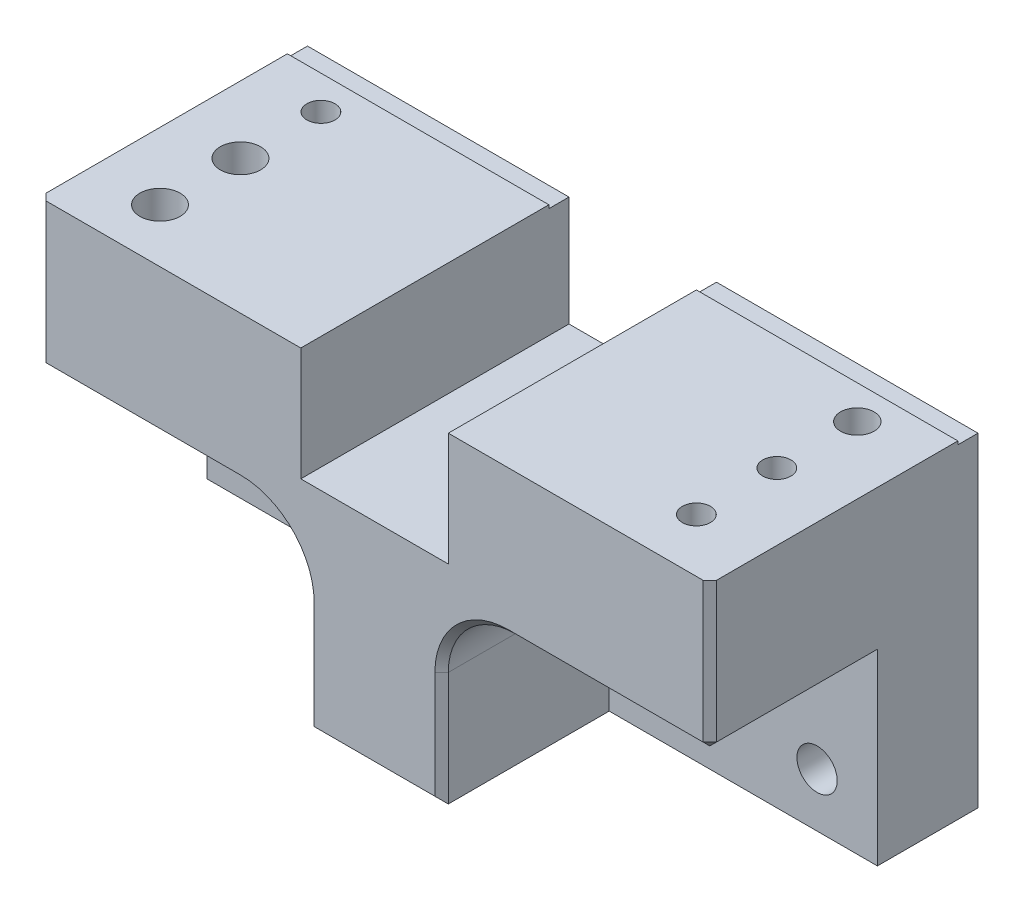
ISO-10303-21;
HEADER;
FILE_DESCRIPTION(('STEP AP214'),'2;1');
FILE_NAME('part.step','',(''),(''),'','','');
FILE_SCHEMA(('AUTOMOTIVE_DESIGN { 1 0 10303 214 1 1 1 1 }'));
ENDSEC;
DATA;
#1=APPLICATION_CONTEXT('core data for automotive mechanical design processes');
#2=APPLICATION_PROTOCOL_DEFINITION('international standard','automotive_design',2000,#1);
#3=PRODUCT_CONTEXT('',#1,'mechanical');
#4=PRODUCT('Part','Part','',(#3));
#5=PRODUCT_RELATED_PRODUCT_CATEGORY('part','',(#4));
#6=PRODUCT_DEFINITION_FORMATION('','',#4);
#7=PRODUCT_DEFINITION_CONTEXT('part definition',#1,'design');
#8=PRODUCT_DEFINITION('design','',#6,#7);
#9=PRODUCT_DEFINITION_SHAPE('','',#8);
#10=(LENGTH_UNIT() NAMED_UNIT(*) SI_UNIT(.MILLI.,.METRE.));
#11=(NAMED_UNIT(*) PLANE_ANGLE_UNIT() SI_UNIT($,.RADIAN.));
#12=(NAMED_UNIT(*) SI_UNIT($,.STERADIAN.) SOLID_ANGLE_UNIT());
#13=UNCERTAINTY_MEASURE_WITH_UNIT(LENGTH_MEASURE(1.E-05),#10,'distance_accuracy_value','');
#14=(GEOMETRIC_REPRESENTATION_CONTEXT(3) GLOBAL_UNCERTAINTY_ASSIGNED_CONTEXT((#13)) GLOBAL_UNIT_ASSIGNED_CONTEXT((#10,
#11,#12)) REPRESENTATION_CONTEXT('',''));
#15=CARTESIAN_POINT('',(0.,0.,0.));
#16=DIRECTION('',(0.,0.,1.));
#17=DIRECTION('',(1.,0.,0.));
#18=AXIS2_PLACEMENT_3D('',#15,#16,#17);
#19=CARTESIAN_POINT('',(-50.,48.9,40.));
#20=DIRECTION('',(1.,0.,0.));
#21=DIRECTION('',(0.,1.,0.));
#22=AXIS2_PLACEMENT_3D('',#19,#20,#21);
#23=PLANE('',#22);
#24=DIRECTION('',(0.,-1.,0.));
#25=VECTOR('',#24,1.);
#26=CARTESIAN_POINT('',(-50.,27.,15.));
#27=LINE('',#26,#25);
#28=CARTESIAN_POINT('',(-50.,28.,15.));
#29=VERTEX_POINT('',#28);
#30=CARTESIAN_POINT('',(-50.,0.,15.));
#31=VERTEX_POINT('',#30);
#32=EDGE_CURVE('E289',#29,#31,#27,.T.);
#33=ORIENTED_EDGE('',*,*,#32,.F.);
#34=DIRECTION('',(0.,0.,1.));
#35=VECTOR('',#34,1.);
#36=CARTESIAN_POINT('',(-50.,28.,40.));
#37=LINE('',#36,#35);
#38=CARTESIAN_POINT('',(-50.,28.,39.));
#39=VERTEX_POINT('',#38);
#40=EDGE_CURVE('E400',#29,#39,#37,.T.);
#41=ORIENTED_EDGE('',*,*,#40,.T.);
#42=DIRECTION('',(0.,1.,0.));
#43=VECTOR('',#42,1.);
#44=CARTESIAN_POINT('',(-50.,48.9,39.));
#45=LINE('',#44,#43);
#46=CARTESIAN_POINT('',(-50.,48.9,39.));
#47=VERTEX_POINT('',#46);
#48=EDGE_CURVE('E229',#39,#47,#45,.T.);
#49=ORIENTED_EDGE('',*,*,#48,.T.);
#50=DIRECTION('',(0.,0.,-1.));
#51=VECTOR('',#50,1.);
#52=CARTESIAN_POINT('',(-50.,48.9,40.));
#53=LINE('',#52,#51);
#54=CARTESIAN_POINT('',(-50.,48.9,3.00000000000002));
#55=VERTEX_POINT('',#54);
#56=EDGE_CURVE('E223',#47,#55,#53,.T.);
#57=ORIENTED_EDGE('',*,*,#56,.T.);
#58=DIRECTION('',(0.,1.,0.));
#59=VECTOR('',#58,1.);
#60=CARTESIAN_POINT('',(-50.,48.4,3.00000000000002));
#61=LINE('',#60,#59);
#62=CARTESIAN_POINT('',(-50.,48.4,3.00000000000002));
#63=VERTEX_POINT('',#62);
#64=EDGE_CURVE('E226',#63,#55,#61,.T.);
#65=ORIENTED_EDGE('',*,*,#64,.F.);
#66=DIRECTION('',(0.,0.,1.));
#67=VECTOR('',#66,1.);
#68=CARTESIAN_POINT('',(-50.,48.4,3.00000000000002));
#69=LINE('',#68,#67);
#70=CARTESIAN_POINT('',(-50.,48.4,0.));
#71=VERTEX_POINT('',#70);
#72=EDGE_CURVE('E260',#71,#63,#69,.T.);
#73=ORIENTED_EDGE('',*,*,#72,.F.);
#74=DIRECTION('',(0.,-1.,0.));
#75=VECTOR('',#74,1.);
#76=CARTESIAN_POINT('',(-50.,48.9,0.));
#77=LINE('',#76,#75);
#78=CARTESIAN_POINT('',(-50.,0.,0.));
#79=VERTEX_POINT('',#78);
#80=EDGE_CURVE('E354',#71,#79,#77,.T.);
#81=ORIENTED_EDGE('',*,*,#80,.T.);
#82=DIRECTION('',(0.,0.,-1.));
#83=VECTOR('',#82,1.);
#84=CARTESIAN_POINT('',(-50.,0.,40.));
#85=LINE('',#84,#83);
#86=EDGE_CURVE('E393',#31,#79,#85,.T.);
#87=ORIENTED_EDGE('',*,*,#86,.F.);
#88=EDGE_LOOP('',(#33,#41,#49,#57,#65,#73,#81,#87));
#89=FACE_BOUND('',#88,.T.);
#90=ADVANCED_FACE('F36',(#89),#23,.F.);
#91=CARTESIAN_POINT('',(-50.,0.,40.));
#92=DIRECTION('',(0.,1.,0.));
#93=DIRECTION('',(-1.,0.,0.));
#94=AXIS2_PLACEMENT_3D('',#91,#92,#93);
#95=PLANE('',#94);
#96=DIRECTION('',(0.,0.,1.));
#97=VECTOR('',#96,1.);
#98=CARTESIAN_POINT('',(10.,0.,15.));
#99=LINE('',#98,#97);
#100=CARTESIAN_POINT('',(10.,0.,15.));
#101=VERTEX_POINT('',#100);
#102=CARTESIAN_POINT('',(10.,0.,39.));
#103=VERTEX_POINT('',#102);
#104=EDGE_CURVE('E313',#101,#103,#99,.T.);
#105=ORIENTED_EDGE('',*,*,#104,.T.);
#106=DIRECTION('',(-1.,0.,0.));
#107=VECTOR('',#106,1.);
#108=CARTESIAN_POINT('',(-9.99999999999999,0.,39.));
#109=LINE('',#108,#107);
#110=CARTESIAN_POINT('',(-9.99999999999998,0.,39.));
#111=VERTEX_POINT('',#110);
#112=EDGE_CURVE('E439',#103,#111,#109,.T.);
#113=ORIENTED_EDGE('',*,*,#112,.T.);
#114=DIRECTION('',(0.,0.,1.));
#115=VECTOR('',#114,1.);
#116=CARTESIAN_POINT('',(-9.99999999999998,0.,15.));
#117=LINE('',#116,#115);
#118=CARTESIAN_POINT('',(-9.99999999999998,0.,15.));
#119=VERTEX_POINT('',#118);
#120=EDGE_CURVE('E291',#119,#111,#117,.T.);
#121=ORIENTED_EDGE('',*,*,#120,.F.);
#122=DIRECTION('',(1.,0.,0.));
#123=VECTOR('',#122,1.);
#124=CARTESIAN_POINT('',(-50.,0.,15.));
#125=LINE('',#124,#123);
#126=EDGE_CURVE('E277',#31,#119,#125,.T.);
#127=ORIENTED_EDGE('',*,*,#126,.F.);
#128=ORIENTED_EDGE('',*,*,#86,.T.);
#129=DIRECTION('',(1.,0.,0.));
#130=VECTOR('',#129,1.);
#131=CARTESIAN_POINT('',(-50.,0.,0.));
#132=LINE('',#131,#130);
#133=CARTESIAN_POINT('',(50.,0.,0.));
#134=VERTEX_POINT('',#133);
#135=EDGE_CURVE('E356',#79,#134,#132,.T.);
#136=ORIENTED_EDGE('',*,*,#135,.T.);
#137=DIRECTION('',(0.,0.,-1.));
#138=VECTOR('',#137,1.);
#139=CARTESIAN_POINT('',(50.,0.,40.));
#140=LINE('',#139,#138);
#141=CARTESIAN_POINT('',(50.,0.,15.));
#142=VERTEX_POINT('',#141);
#143=EDGE_CURVE('E391',#142,#134,#140,.T.);
#144=ORIENTED_EDGE('',*,*,#143,.F.);
#145=DIRECTION('',(1.,0.,0.));
#146=VECTOR('',#145,1.);
#147=CARTESIAN_POINT('',(10.,0.,15.));
#148=LINE('',#147,#146);
#149=EDGE_CURVE('E295',#101,#142,#148,.T.);
#150=ORIENTED_EDGE('',*,*,#149,.F.);
#151=EDGE_LOOP('',(#105,#113,#121,#127,#128,#136,#144,#150));
#152=FACE_BOUND('',#151,.T.);
#153=ADVANCED_FACE('F461',(#152),#95,.F.);
#154=CARTESIAN_POINT('',(50.,48.9,40.));
#155=DIRECTION('',(-1.,0.,0.));
#156=DIRECTION('',(0.,-1.,0.));
#157=AXIS2_PLACEMENT_3D('',#154,#155,#156);
#158=PLANE('',#157);
#159=DIRECTION('',(0.,0.,-1.));
#160=VECTOR('',#159,1.);
#161=CARTESIAN_POINT('',(50.,28.,40.));
#162=LINE('',#161,#160);
#163=CARTESIAN_POINT('',(50.,28.,39.));
#164=VERTEX_POINT('',#163);
#165=CARTESIAN_POINT('',(50.,28.,15.));
#166=VERTEX_POINT('',#165);
#167=EDGE_CURVE('E412',#164,#166,#162,.T.);
#168=ORIENTED_EDGE('',*,*,#167,.T.);
#169=DIRECTION('',(0.,1.,0.));
#170=VECTOR('',#169,1.);
#171=CARTESIAN_POINT('',(50.,0.,15.));
#172=LINE('',#171,#170);
#173=EDGE_CURVE('E302',#142,#166,#172,.T.);
#174=ORIENTED_EDGE('',*,*,#173,.F.);
#175=ORIENTED_EDGE('',*,*,#143,.T.);
#176=DIRECTION('',(0.,1.,0.));
#177=VECTOR('',#176,1.);
#178=CARTESIAN_POINT('',(50.,48.9,0.));
#179=LINE('',#178,#177);
#180=CARTESIAN_POINT('',(50.,48.4,0.));
#181=VERTEX_POINT('',#180);
#182=EDGE_CURVE('E359',#134,#181,#179,.T.);
#183=ORIENTED_EDGE('',*,*,#182,.T.);
#184=DIRECTION('',(0.,0.,-1.));
#185=VECTOR('',#184,1.);
#186=CARTESIAN_POINT('',(50.,48.4,3.00000000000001));
#187=LINE('',#186,#185);
#188=CARTESIAN_POINT('',(50.,48.4,3.00000000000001));
#189=VERTEX_POINT('',#188);
#190=EDGE_CURVE('E249',#189,#181,#187,.T.);
#191=ORIENTED_EDGE('',*,*,#190,.F.);
#192=DIRECTION('',(0.,1.,0.));
#193=VECTOR('',#192,1.);
#194=CARTESIAN_POINT('',(50.,48.4,3.00000000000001));
#195=LINE('',#194,#193);
#196=CARTESIAN_POINT('',(50.,48.9,3.00000000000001));
#197=VERTEX_POINT('',#196);
#198=EDGE_CURVE('E243',#189,#197,#195,.T.);
#199=ORIENTED_EDGE('',*,*,#198,.T.);
#200=DIRECTION('',(0.,0.,-1.));
#201=VECTOR('',#200,1.);
#202=CARTESIAN_POINT('',(50.,48.9,40.));
#203=LINE('',#202,#201);
#204=CARTESIAN_POINT('',(50.,48.9,39.));
#205=VERTEX_POINT('',#204);
#206=EDGE_CURVE('E389',#205,#197,#203,.T.);
#207=ORIENTED_EDGE('',*,*,#206,.F.);
#208=DIRECTION('',(0.,-1.,0.));
#209=VECTOR('',#208,1.);
#210=CARTESIAN_POINT('',(50.,27.,39.));
#211=LINE('',#210,#209);
#212=EDGE_CURVE('E410',#205,#164,#211,.T.);
#213=ORIENTED_EDGE('',*,*,#212,.T.);
#214=EDGE_LOOP('',(#168,#174,#175,#183,#191,#199,#207,#213));
#215=FACE_BOUND('',#214,.T.);
#216=ADVANCED_FACE('F471',(#215),#158,.F.);
#217=CARTESIAN_POINT('',(11.,48.9,40.));
#218=DIRECTION('',(0.,-1.,0.));
#219=DIRECTION('',(1.,0.,0.));
#220=AXIS2_PLACEMENT_3D('',#217,#218,#219);
#221=PLANE('',#220);
#222=CARTESIAN_POINT('',(40.,48.9,32.));
#223=DIRECTION('',(0.,1.,0.));
#224=DIRECTION('',(0.,0.,1.));
#225=AXIS2_PLACEMENT_3D('',#222,#223,#224);
#226=CIRCLE('',#225,2.09999999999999);
#227=CARTESIAN_POINT('',(40.,48.9,34.1));
#228=VERTEX_POINT('',#227);
#229=EDGE_CURVE('E327',#228,#228,#226,.T.);
#230=ORIENTED_EDGE('',*,*,#229,.F.);
#231=EDGE_LOOP('',(#230));
#232=FACE_BOUND('',#231,.T.);
#233=CARTESIAN_POINT('',(40.,48.9,20.));
#234=DIRECTION('',(0.,1.,0.));
#235=DIRECTION('',(0.,0.,1.));
#236=AXIS2_PLACEMENT_3D('',#233,#234,#235);
#237=CIRCLE('',#236,2.09999999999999);
#238=CARTESIAN_POINT('',(40.,48.9,22.1));
#239=VERTEX_POINT('',#238);
#240=EDGE_CURVE('E333',#239,#239,#237,.T.);
#241=ORIENTED_EDGE('',*,*,#240,.F.);
#242=EDGE_LOOP('',(#241));
#243=FACE_BOUND('',#242,.T.);
#244=CARTESIAN_POINT('',(40.,48.9,7.99999999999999));
#245=DIRECTION('',(0.,1.,0.));
#246=DIRECTION('',(-1.,0.,0.));
#247=AXIS2_PLACEMENT_3D('',#244,#245,#246);
#248=CIRCLE('',#247,2.5035);
#249=CARTESIAN_POINT('',(37.4965,48.9,7.99999999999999));
#250=VERTEX_POINT('',#249);
#251=EDGE_CURVE('E342',#250,#250,#248,.T.);
#252=ORIENTED_EDGE('',*,*,#251,.F.);
#253=EDGE_LOOP('',(#252));
#254=FACE_BOUND('',#253,.T.);
#255=DIRECTION('',(-1.,0.,0.));
#256=VECTOR('',#255,1.);
#257=CARTESIAN_POINT('',(11.,48.9,40.));
#258=LINE('',#257,#256);
#259=CARTESIAN_POINT('',(49.,48.9,40.));
#260=VERTEX_POINT('',#259);
#261=CARTESIAN_POINT('',(11.,48.9,40.));
#262=VERTEX_POINT('',#261);
#263=EDGE_CURVE('E369',#260,#262,#258,.T.);
#264=ORIENTED_EDGE('',*,*,#263,.F.);
#265=DIRECTION('',(0.707106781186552,0.,-0.707106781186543));
#266=VECTOR('',#265,1.);
#267=CARTESIAN_POINT('',(49.,48.9,40.));
#268=LINE('',#267,#266);
#269=EDGE_CURVE('E443',#260,#205,#268,.T.);
#270=ORIENTED_EDGE('',*,*,#269,.T.);
#271=ORIENTED_EDGE('',*,*,#206,.T.);
#272=DIRECTION('',(1.,0.,0.));
#273=VECTOR('',#272,1.);
#274=CARTESIAN_POINT('',(-50.,48.9,3.00000000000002));
#275=LINE('',#274,#273);
#276=CARTESIAN_POINT('',(11.,48.9,3.00000000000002));
#277=VERTEX_POINT('',#276);
#278=EDGE_CURVE('E250',#277,#197,#275,.T.);
#279=ORIENTED_EDGE('',*,*,#278,.F.);
#280=DIRECTION('',(0.,0.,-1.));
#281=VECTOR('',#280,1.);
#282=CARTESIAN_POINT('',(11.,48.9,40.));
#283=LINE('',#282,#281);
#284=EDGE_CURVE('E386',#262,#277,#283,.T.);
#285=ORIENTED_EDGE('',*,*,#284,.F.);
#286=EDGE_LOOP('',(#264,#270,#271,#279,#285));
#287=FACE_BOUND('',#286,.T.);
#288=ADVANCED_FACE('F601',(#232,#243,#254,#287),#221,.F.);
#289=CARTESIAN_POINT('',(11.,32.,40.));
#290=DIRECTION('',(1.,0.,0.));
#291=DIRECTION('',(0.,1.,0.));
#292=AXIS2_PLACEMENT_3D('',#289,#290,#291);
#293=PLANE('',#292);
#294=ORIENTED_EDGE('',*,*,#284,.T.);
#295=DIRECTION('',(0.,-1.,0.));
#296=VECTOR('',#295,1.);
#297=CARTESIAN_POINT('',(11.,32.,3.00000000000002));
#298=LINE('',#297,#296);
#299=CARTESIAN_POINT('',(11.,48.4,3.00000000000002));
#300=VERTEX_POINT('',#299);
#301=EDGE_CURVE('E274',#277,#300,#298,.T.);
#302=ORIENTED_EDGE('',*,*,#301,.T.);
#303=DIRECTION('',(0.,0.,-1.));
#304=VECTOR('',#303,1.);
#305=CARTESIAN_POINT('',(11.,48.4,40.));
#306=LINE('',#305,#304);
#307=CARTESIAN_POINT('',(11.,48.4,0.));
#308=VERTEX_POINT('',#307);
#309=EDGE_CURVE('E269',#300,#308,#306,.T.);
#310=ORIENTED_EDGE('',*,*,#309,.T.);
#311=DIRECTION('',(0.,-1.,0.));
#312=VECTOR('',#311,1.);
#313=CARTESIAN_POINT('',(11.,32.,0.));
#314=LINE('',#313,#312);
#315=CARTESIAN_POINT('',(11.,32.,0.));
#316=VERTEX_POINT('',#315);
#317=EDGE_CURVE('E362',#308,#316,#314,.T.);
#318=ORIENTED_EDGE('',*,*,#317,.T.);
#319=DIRECTION('',(0.,0.,-1.));
#320=VECTOR('',#319,1.);
#321=CARTESIAN_POINT('',(11.,32.,40.));
#322=LINE('',#321,#320);
#323=CARTESIAN_POINT('',(11.,32.,40.));
#324=VERTEX_POINT('',#323);
#325=EDGE_CURVE('E383',#324,#316,#322,.T.);
#326=ORIENTED_EDGE('',*,*,#325,.F.);
#327=DIRECTION('',(0.,-1.,0.));
#328=VECTOR('',#327,1.);
#329=CARTESIAN_POINT('',(11.,32.,40.));
#330=LINE('',#329,#328);
#331=EDGE_CURVE('E371',#262,#324,#330,.T.);
#332=ORIENTED_EDGE('',*,*,#331,.F.);
#333=EDGE_LOOP('',(#294,#302,#310,#318,#326,#332));
#334=FACE_BOUND('',#333,.T.);
#335=ADVANCED_FACE('F606',(#334),#293,.F.);
#336=CARTESIAN_POINT('',(-11.,32.,40.));
#337=DIRECTION('',(0.,-1.,0.));
#338=DIRECTION('',(0.,0.,-1.));
#339=AXIS2_PLACEMENT_3D('',#336,#337,#338);
#340=PLANE('',#339);
#341=DIRECTION('',(-1.,0.,0.));
#342=VECTOR('',#341,1.);
#343=CARTESIAN_POINT('',(-11.,32.,0.));
#344=LINE('',#343,#342);
#345=CARTESIAN_POINT('',(-11.,32.,0.));
#346=VERTEX_POINT('',#345);
#347=EDGE_CURVE('E364',#316,#346,#344,.T.);
#348=ORIENTED_EDGE('',*,*,#347,.T.);
#349=DIRECTION('',(0.,0.,-1.));
#350=VECTOR('',#349,1.);
#351=CARTESIAN_POINT('',(-11.,32.,40.));
#352=LINE('',#351,#350);
#353=CARTESIAN_POINT('',(-11.,32.,40.));
#354=VERTEX_POINT('',#353);
#355=EDGE_CURVE('E380',#354,#346,#352,.T.);
#356=ORIENTED_EDGE('',*,*,#355,.F.);
#357=DIRECTION('',(-1.,0.,0.));
#358=VECTOR('',#357,1.);
#359=CARTESIAN_POINT('',(-11.,32.,40.));
#360=LINE('',#359,#358);
#361=EDGE_CURVE('E373',#324,#354,#360,.T.);
#362=ORIENTED_EDGE('',*,*,#361,.F.);
#363=ORIENTED_EDGE('',*,*,#325,.T.);
#364=EDGE_LOOP('',(#348,#356,#362,#363));
#365=FACE_BOUND('',#364,.T.);
#366=ADVANCED_FACE('F610',(#365),#340,.F.);
#367=CARTESIAN_POINT('',(-11.,32.,40.));
#368=DIRECTION('',(-1.,0.,0.));
#369=DIRECTION('',(0.,-1.,0.));
#370=AXIS2_PLACEMENT_3D('',#367,#368,#369);
#371=PLANE('',#370);
#372=DIRECTION('',(0.,0.,1.));
#373=VECTOR('',#372,1.);
#374=CARTESIAN_POINT('',(-11.,48.4,40.));
#375=LINE('',#374,#373);
#376=CARTESIAN_POINT('',(-11.,48.4,0.));
#377=VERTEX_POINT('',#376);
#378=CARTESIAN_POINT('',(-11.,48.4,3.00000000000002));
#379=VERTEX_POINT('',#378);
#380=EDGE_CURVE('E265',#377,#379,#375,.T.);
#381=ORIENTED_EDGE('',*,*,#380,.T.);
#382=DIRECTION('',(0.,1.,0.));
#383=VECTOR('',#382,1.);
#384=CARTESIAN_POINT('',(-11.,32.,3.00000000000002));
#385=LINE('',#384,#383);
#386=CARTESIAN_POINT('',(-11.,48.9,3.00000000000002));
#387=VERTEX_POINT('',#386);
#388=EDGE_CURVE('E272',#379,#387,#385,.T.);
#389=ORIENTED_EDGE('',*,*,#388,.T.);
#390=DIRECTION('',(0.,0.,-1.));
#391=VECTOR('',#390,1.);
#392=CARTESIAN_POINT('',(-11.,48.9,40.));
#393=LINE('',#392,#391);
#394=CARTESIAN_POINT('',(-11.,48.9,40.));
#395=VERTEX_POINT('',#394);
#396=EDGE_CURVE('E233',#395,#387,#393,.T.);
#397=ORIENTED_EDGE('',*,*,#396,.F.);
#398=DIRECTION('',(0.,1.,0.));
#399=VECTOR('',#398,1.);
#400=CARTESIAN_POINT('',(-11.,32.,40.));
#401=LINE('',#400,#399);
#402=EDGE_CURVE('E375',#354,#395,#401,.T.);
#403=ORIENTED_EDGE('',*,*,#402,.F.);
#404=ORIENTED_EDGE('',*,*,#355,.T.);
#405=DIRECTION('',(0.,1.,0.));
#406=VECTOR('',#405,1.);
#407=CARTESIAN_POINT('',(-11.,32.,0.));
#408=LINE('',#407,#406);
#409=EDGE_CURVE('E366',#346,#377,#408,.T.);
#410=ORIENTED_EDGE('',*,*,#409,.T.);
#411=EDGE_LOOP('',(#381,#389,#397,#403,#404,#410));
#412=FACE_BOUND('',#411,.T.);
#413=ADVANCED_FACE('F614',(#412),#371,.F.);
#414=CARTESIAN_POINT('',(-50.,48.9,40.));
#415=DIRECTION('',(0.,-1.,0.));
#416=DIRECTION('',(0.,0.,-1.));
#417=AXIS2_PLACEMENT_3D('',#414,#415,#416);
#418=PLANE('',#417);
#419=CARTESIAN_POINT('',(-40.,48.9,8.00000000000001));
#420=DIRECTION('',(0.,1.,0.));
#421=DIRECTION('',(0.,0.,1.));
#422=AXIS2_PLACEMENT_3D('',#419,#420,#421);
#423=CIRCLE('',#422,2.09999999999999);
#424=CARTESIAN_POINT('',(-40.,48.9,10.1));
#425=VERTEX_POINT('',#424);
#426=EDGE_CURVE('E321',#425,#425,#423,.T.);
#427=ORIENTED_EDGE('',*,*,#426,.F.);
#428=EDGE_LOOP('',(#427));
#429=FACE_BOUND('',#428,.T.);
#430=CARTESIAN_POINT('',(-40.,48.9,20.));
#431=DIRECTION('',(0.,1.,0.));
#432=DIRECTION('',(-1.,0.,0.));
#433=AXIS2_PLACEMENT_3D('',#430,#431,#432);
#434=CIRCLE('',#433,3.004);
#435=CARTESIAN_POINT('',(-43.004,48.9,20.));
#436=VERTEX_POINT('',#435);
#437=EDGE_CURVE('E336',#436,#436,#434,.T.);
#438=ORIENTED_EDGE('',*,*,#437,.F.);
#439=EDGE_LOOP('',(#438));
#440=FACE_BOUND('',#439,.T.);
#441=CARTESIAN_POINT('',(-40.,48.9,32.));
#442=DIRECTION('',(0.,1.,0.));
#443=DIRECTION('',(-1.,0.,0.));
#444=AXIS2_PLACEMENT_3D('',#441,#442,#443);
#445=CIRCLE('',#444,3.004);
#446=CARTESIAN_POINT('',(-43.004,48.9,32.));
#447=VERTEX_POINT('',#446);
#448=EDGE_CURVE('E348',#447,#447,#445,.T.);
#449=ORIENTED_EDGE('',*,*,#448,.F.);
#450=EDGE_LOOP('',(#449));
#451=FACE_BOUND('',#450,.T.);
#452=ORIENTED_EDGE('',*,*,#56,.F.);
#453=DIRECTION('',(0.707106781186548,0.,0.707106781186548));
#454=VECTOR('',#453,1.);
#455=CARTESIAN_POINT('',(-49.,48.9,40.));
#456=LINE('',#455,#454);
#457=CARTESIAN_POINT('',(-49.,48.9,40.));
#458=VERTEX_POINT('',#457);
#459=EDGE_CURVE('E433',#47,#458,#456,.T.);
#460=ORIENTED_EDGE('',*,*,#459,.T.);
#461=DIRECTION('',(-1.,0.,0.));
#462=VECTOR('',#461,1.);
#463=CARTESIAN_POINT('',(-50.,48.9,40.));
#464=LINE('',#463,#462);
#465=EDGE_CURVE('E234',#395,#458,#464,.T.);
#466=ORIENTED_EDGE('',*,*,#465,.F.);
#467=ORIENTED_EDGE('',*,*,#396,.T.);
#468=EDGE_CURVE('E239',#55,#387,#275,.T.);
#469=ORIENTED_EDGE('',*,*,#468,.F.);
#470=EDGE_LOOP('',(#452,#460,#466,#467,#469));
#471=FACE_BOUND('',#470,.T.);
#472=ADVANCED_FACE('F246',(#429,#440,#451,#471),#418,.F.);
#473=CARTESIAN_POINT('',(-50.,0.,40.));
#474=DIRECTION('',(0.,0.,1.));
#475=DIRECTION('',(1.,0.,0.));
#476=AXIS2_PLACEMENT_3D('',#473,#474,#475);
#477=PLANE('',#476);
#478=ORIENTED_EDGE('',*,*,#465,.T.);
#479=DIRECTION('',(0.,-1.,0.));
#480=VECTOR('',#479,1.);
#481=CARTESIAN_POINT('',(-49.,27.,40.));
#482=LINE('',#481,#480);
#483=CARTESIAN_POINT('',(-49.,28.,40.));
#484=VERTEX_POINT('',#483);
#485=EDGE_CURVE('E431',#458,#484,#482,.T.);
#486=ORIENTED_EDGE('',*,*,#485,.T.);
#487=DIRECTION('',(1.,0.,0.));
#488=VECTOR('',#487,1.);
#489=CARTESIAN_POINT('',(-20.,28.,40.));
#490=LINE('',#489,#488);
#491=CARTESIAN_POINT('',(-20.,28.,40.));
#492=VERTEX_POINT('',#491);
#493=EDGE_CURVE('E429',#484,#492,#490,.T.);
#494=ORIENTED_EDGE('',*,*,#493,.T.);
#495=CARTESIAN_POINT('',(-20.,17.,40.));
#496=DIRECTION('',(0.,0.,1.));
#497=DIRECTION('',(1.,0.,0.));
#498=AXIS2_PLACEMENT_3D('',#495,#496,#497);
#499=CIRCLE('',#498,11.);
#500=CARTESIAN_POINT('',(-8.99999999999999,17.,40.));
#501=VERTEX_POINT('',#500);
#502=EDGE_CURVE('E427',#492,#501,#499,.F.);
#503=ORIENTED_EDGE('',*,*,#502,.T.);
#504=DIRECTION('',(0.,-1.,0.));
#505=VECTOR('',#504,1.);
#506=CARTESIAN_POINT('',(-8.99999999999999,0.,40.));
#507=LINE('',#506,#505);
#508=CARTESIAN_POINT('',(-8.99999999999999,1.00000000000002,40.));
#509=VERTEX_POINT('',#508);
#510=EDGE_CURVE('E425',#501,#509,#507,.T.);
#511=ORIENTED_EDGE('',*,*,#510,.T.);
#512=DIRECTION('',(1.,0.,0.));
#513=VECTOR('',#512,1.);
#514=CARTESIAN_POINT('',(10.,1.00000000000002,40.));
#515=LINE('',#514,#513);
#516=CARTESIAN_POINT('',(9.00000000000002,1.00000000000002,40.));
#517=VERTEX_POINT('',#516);
#518=EDGE_CURVE('E423',#509,#517,#515,.T.);
#519=ORIENTED_EDGE('',*,*,#518,.T.);
#520=DIRECTION('',(0.,1.,0.));
#521=VECTOR('',#520,1.);
#522=CARTESIAN_POINT('',(9.00000000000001,17.,40.));
#523=LINE('',#522,#521);
#524=CARTESIAN_POINT('',(9.00000000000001,17.,40.));
#525=VERTEX_POINT('',#524);
#526=EDGE_CURVE('E421',#517,#525,#523,.T.);
#527=ORIENTED_EDGE('',*,*,#526,.T.);
#528=CARTESIAN_POINT('',(20.,17.,40.));
#529=DIRECTION('',(0.,0.,1.));
#530=DIRECTION('',(1.,0.,0.));
#531=AXIS2_PLACEMENT_3D('',#528,#529,#530);
#532=CIRCLE('',#531,11.);
#533=CARTESIAN_POINT('',(20.,28.,40.));
#534=VERTEX_POINT('',#533);
#535=EDGE_CURVE('E419',#525,#534,#532,.F.);
#536=ORIENTED_EDGE('',*,*,#535,.T.);
#537=DIRECTION('',(1.,0.,0.));
#538=VECTOR('',#537,1.);
#539=CARTESIAN_POINT('',(50.,28.,40.));
#540=LINE('',#539,#538);
#541=CARTESIAN_POINT('',(49.,28.,40.));
#542=VERTEX_POINT('',#541);
#543=EDGE_CURVE('E417',#534,#542,#540,.T.);
#544=ORIENTED_EDGE('',*,*,#543,.T.);
#545=DIRECTION('',(0.,1.,0.));
#546=VECTOR('',#545,1.);
#547=CARTESIAN_POINT('',(49.,48.9,40.));
#548=LINE('',#547,#546);
#549=EDGE_CURVE('E415',#542,#260,#548,.T.);
#550=ORIENTED_EDGE('',*,*,#549,.T.);
#551=ORIENTED_EDGE('',*,*,#263,.T.);
#552=ORIENTED_EDGE('',*,*,#331,.T.);
#553=ORIENTED_EDGE('',*,*,#361,.T.);
#554=ORIENTED_EDGE('',*,*,#402,.T.);
#555=EDGE_LOOP('',(#478,#486,#494,#503,#511,#519,#527,#536,#544,#550,#551,#552,#553,#554));
#556=FACE_BOUND('',#555,.T.);
#557=ADVANCED_FACE('F621',(#556),#477,.T.);
#558=CARTESIAN_POINT('',(-50.,0.,0.));
#559=DIRECTION('',(0.,0.,1.));
#560=DIRECTION('',(1.,0.,0.));
#561=AXIS2_PLACEMENT_3D('',#558,#559,#560);
#562=PLANE('',#561);
#563=CARTESIAN_POINT('',(20.,17.,0.));
#564=DIRECTION('',(0.,0.,1.));
#565=DIRECTION('',(1.,0.,0.));
#566=AXIS2_PLACEMENT_3D('',#563,#564,#565);
#567=CIRCLE('',#566,2.75);
#568=CARTESIAN_POINT('',(22.75,17.,0.));
#569=VERTEX_POINT('',#568);
#570=EDGE_CURVE('E542',#569,#569,#567,.T.);
#571=ORIENTED_EDGE('',*,*,#570,.T.);
#572=EDGE_LOOP('',(#571));
#573=FACE_BOUND('',#572,.T.);
#574=CARTESIAN_POINT('',(-20.,17.,0.));
#575=DIRECTION('',(0.,0.,1.));
#576=DIRECTION('',(1.,0.,0.));
#577=AXIS2_PLACEMENT_3D('',#574,#575,#576);
#578=CIRCLE('',#577,2.75);
#579=CARTESIAN_POINT('',(-17.25,17.,0.));
#580=VERTEX_POINT('',#579);
#581=EDGE_CURVE('E554',#580,#580,#578,.T.);
#582=ORIENTED_EDGE('',*,*,#581,.T.);
#583=EDGE_LOOP('',(#582));
#584=FACE_BOUND('',#583,.T.);
#585=CARTESIAN_POINT('',(-41.,8.00000000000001,0.));
#586=DIRECTION('',(0.,0.,1.));
#587=DIRECTION('',(1.,0.,0.));
#588=AXIS2_PLACEMENT_3D('',#585,#586,#587);
#589=CIRCLE('',#588,3.004);
#590=CARTESIAN_POINT('',(-37.996,8.00000000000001,0.));
#591=VERTEX_POINT('',#590);
#592=EDGE_CURVE('E569',#591,#591,#589,.T.);
#593=ORIENTED_EDGE('',*,*,#592,.T.);
#594=EDGE_LOOP('',(#593));
#595=FACE_BOUND('',#594,.T.);
#596=CARTESIAN_POINT('',(41.,8.00000000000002,0.));
#597=DIRECTION('',(0.,0.,1.));
#598=DIRECTION('',(1.,0.,0.));
#599=AXIS2_PLACEMENT_3D('',#596,#597,#598);
#600=CIRCLE('',#599,3.004);
#601=CARTESIAN_POINT('',(44.004,8.00000000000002,0.));
#602=VERTEX_POINT('',#601);
#603=EDGE_CURVE('E255',#602,#602,#600,.T.);
#604=ORIENTED_EDGE('',*,*,#603,.T.);
#605=EDGE_LOOP('',(#604));
#606=FACE_BOUND('',#605,.T.);
#607=ORIENTED_EDGE('',*,*,#80,.F.);
#608=DIRECTION('',(1.,0.,0.));
#609=VECTOR('',#608,1.);
#610=CARTESIAN_POINT('',(-50.,48.4,0.));
#611=LINE('',#610,#609);
#612=EDGE_CURVE('E396',#71,#377,#611,.T.);
#613=ORIENTED_EDGE('',*,*,#612,.T.);
#614=ORIENTED_EDGE('',*,*,#409,.F.);
#615=ORIENTED_EDGE('',*,*,#347,.F.);
#616=ORIENTED_EDGE('',*,*,#317,.F.);
#617=DIRECTION('',(-1.,0.,0.));
#618=VECTOR('',#617,1.);
#619=CARTESIAN_POINT('',(50.,48.4,0.));
#620=LINE('',#619,#618);
#621=EDGE_CURVE('E252',#181,#308,#620,.T.);
#622=ORIENTED_EDGE('',*,*,#621,.F.);
#623=ORIENTED_EDGE('',*,*,#182,.F.);
#624=ORIENTED_EDGE('',*,*,#135,.F.);
#625=EDGE_LOOP('',(#607,#613,#614,#615,#616,#622,#623,#624));
#626=FACE_BOUND('',#625,.T.);
#627=ADVANCED_FACE('F466',(#573,#584,#595,#606,#626),#562,.F.);
#628=CARTESIAN_POINT('',(-40.,33.9,32.));
#629=DIRECTION('',(0.,1.,0.));
#630=DIRECTION('',(-1.,0.,0.));
#631=AXIS2_PLACEMENT_3D('',#628,#629,#630);
#632=CYLINDRICAL_SURFACE('',#631,3.004);
#633=CARTESIAN_POINT('',(-40.,33.9,32.));
#634=DIRECTION('',(0.,1.,0.));
#635=DIRECTION('',(-1.,0.,0.));
#636=AXIS2_PLACEMENT_3D('',#633,#634,#635);
#637=CIRCLE('',#636,3.004);
#638=CARTESIAN_POINT('',(-43.004,33.9,32.));
#639=VERTEX_POINT('',#638);
#640=EDGE_CURVE('E351',#639,#639,#637,.T.);
#641=ORIENTED_EDGE('',*,*,#640,.F.);
#642=EDGE_LOOP('',(#641));
#643=FACE_BOUND('',#642,.T.);
#644=ORIENTED_EDGE('',*,*,#448,.T.);
#645=EDGE_LOOP('',(#644));
#646=FACE_BOUND('',#645,.T.);
#647=ADVANCED_FACE('F628',(#643,#646),#632,.F.);
#648=CARTESIAN_POINT('',(-40.,33.9,32.));
#649=DIRECTION('',(0.,1.,0.));
#650=DIRECTION('',(-1.,0.,0.));
#651=AXIS2_PLACEMENT_3D('',#648,#649,#650);
#652=PLANE('',#651);
#653=ORIENTED_EDGE('',*,*,#640,.T.);
#654=EDGE_LOOP('',(#653));
#655=FACE_BOUND('',#654,.T.);
#656=ADVANCED_FACE('F632',(#655),#652,.T.);
#657=CARTESIAN_POINT('',(40.,33.9,7.99999999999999));
#658=DIRECTION('',(0.,1.,0.));
#659=DIRECTION('',(-1.,0.,0.));
#660=AXIS2_PLACEMENT_3D('',#657,#658,#659);
#661=CYLINDRICAL_SURFACE('',#660,2.5035);
#662=CARTESIAN_POINT('',(40.,33.9,7.99999999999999));
#663=DIRECTION('',(0.,1.,0.));
#664=DIRECTION('',(-1.,0.,0.));
#665=AXIS2_PLACEMENT_3D('',#662,#663,#664);
#666=CIRCLE('',#665,2.5035);
#667=CARTESIAN_POINT('',(37.4965,33.9,7.99999999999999));
#668=VERTEX_POINT('',#667);
#669=EDGE_CURVE('E345',#668,#668,#666,.T.);
#670=ORIENTED_EDGE('',*,*,#669,.F.);
#671=EDGE_LOOP('',(#670));
#672=FACE_BOUND('',#671,.T.);
#673=ORIENTED_EDGE('',*,*,#251,.T.);
#674=EDGE_LOOP('',(#673));
#675=FACE_BOUND('',#674,.T.);
#676=ADVANCED_FACE('F636',(#672,#675),#661,.F.);
#677=CARTESIAN_POINT('',(40.,33.9,7.99999999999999));
#678=DIRECTION('',(0.,1.,0.));
#679=DIRECTION('',(-1.,0.,0.));
#680=AXIS2_PLACEMENT_3D('',#677,#678,#679);
#681=PLANE('',#680);
#682=ORIENTED_EDGE('',*,*,#669,.T.);
#683=EDGE_LOOP('',(#682));
#684=FACE_BOUND('',#683,.T.);
#685=ADVANCED_FACE('F640',(#684),#681,.T.);
#686=CARTESIAN_POINT('',(-40.,33.9,20.));
#687=DIRECTION('',(0.,1.,0.));
#688=DIRECTION('',(-1.,0.,0.));
#689=AXIS2_PLACEMENT_3D('',#686,#687,#688);
#690=CYLINDRICAL_SURFACE('',#689,3.004);
#691=CARTESIAN_POINT('',(-40.,33.9,20.));
#692=DIRECTION('',(0.,1.,0.));
#693=DIRECTION('',(-1.,0.,0.));
#694=AXIS2_PLACEMENT_3D('',#691,#692,#693);
#695=CIRCLE('',#694,3.004);
#696=CARTESIAN_POINT('',(-43.004,33.9,20.));
#697=VERTEX_POINT('',#696);
#698=EDGE_CURVE('E339',#697,#697,#695,.T.);
#699=ORIENTED_EDGE('',*,*,#698,.F.);
#700=EDGE_LOOP('',(#699));
#701=FACE_BOUND('',#700,.T.);
#702=ORIENTED_EDGE('',*,*,#437,.T.);
#703=EDGE_LOOP('',(#702));
#704=FACE_BOUND('',#703,.T.);
#705=ADVANCED_FACE('F644',(#701,#704),#690,.F.);
#706=CARTESIAN_POINT('',(-40.,33.9,20.));
#707=DIRECTION('',(0.,1.,0.));
#708=DIRECTION('',(-1.,0.,0.));
#709=AXIS2_PLACEMENT_3D('',#706,#707,#708);
#710=PLANE('',#709);
#711=ORIENTED_EDGE('',*,*,#698,.T.);
#712=EDGE_LOOP('',(#711));
#713=FACE_BOUND('',#712,.T.);
#714=ADVANCED_FACE('F648',(#713),#710,.T.);
#715=CARTESIAN_POINT('',(40.,48.9,20.));
#716=DIRECTION('',(0.,1.,0.));
#717=DIRECTION('',(0.,0.,1.));
#718=AXIS2_PLACEMENT_3D('',#715,#716,#717);
#719=CYLINDRICAL_SURFACE('',#718,2.09999999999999);
#720=CARTESIAN_POINT('',(40.,36.5,20.));
#721=DIRECTION('',(0.,1.,0.));
#722=DIRECTION('',(0.,0.,1.));
#723=AXIS2_PLACEMENT_3D('',#720,#721,#722);
#724=CIRCLE('',#723,2.09999999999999);
#725=CARTESIAN_POINT('',(40.,36.5,22.1));
#726=VERTEX_POINT('',#725);
#727=EDGE_CURVE('E330',#726,#726,#724,.T.);
#728=ORIENTED_EDGE('',*,*,#727,.F.);
#729=EDGE_LOOP('',(#728));
#730=FACE_BOUND('',#729,.T.);
#731=ORIENTED_EDGE('',*,*,#240,.T.);
#732=EDGE_LOOP('',(#731));
#733=FACE_BOUND('',#732,.T.);
#734=ADVANCED_FACE('F652',(#730,#733),#719,.F.);
#735=CARTESIAN_POINT('',(40.,36.5,20.));
#736=DIRECTION('',(0.,1.,0.));
#737=DIRECTION('',(0.,0.,1.));
#738=AXIS2_PLACEMENT_3D('',#735,#736,#737);
#739=CONICAL_SURFACE('',#738,2.09999999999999,1.02974425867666);
#740=CARTESIAN_POINT('',(40.,35.2381927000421,20.));
#741=VERTEX_POINT('',#740);
#742=VERTEX_LOOP('',#741);
#743=FACE_BOUND('',#742,.T.);
#744=ORIENTED_EDGE('',*,*,#727,.T.);
#745=EDGE_LOOP('',(#744));
#746=FACE_BOUND('',#745,.T.);
#747=ADVANCED_FACE('F656',(#743,#746),#739,.F.);
#748=CARTESIAN_POINT('',(40.,48.9,32.));
#749=DIRECTION('',(0.,1.,0.));
#750=DIRECTION('',(0.,0.,1.));
#751=AXIS2_PLACEMENT_3D('',#748,#749,#750);
#752=CYLINDRICAL_SURFACE('',#751,2.09999999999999);
#753=CARTESIAN_POINT('',(40.,36.5,32.));
#754=DIRECTION('',(0.,1.,0.));
#755=DIRECTION('',(0.,0.,1.));
#756=AXIS2_PLACEMENT_3D('',#753,#754,#755);
#757=CIRCLE('',#756,2.09999999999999);
#758=CARTESIAN_POINT('',(40.,36.5,34.1));
#759=VERTEX_POINT('',#758);
#760=EDGE_CURVE('E324',#759,#759,#757,.T.);
#761=ORIENTED_EDGE('',*,*,#760,.F.);
#762=EDGE_LOOP('',(#761));
#763=FACE_BOUND('',#762,.T.);
#764=ORIENTED_EDGE('',*,*,#229,.T.);
#765=EDGE_LOOP('',(#764));
#766=FACE_BOUND('',#765,.T.);
#767=ADVANCED_FACE('F660',(#763,#766),#752,.F.);
#768=CARTESIAN_POINT('',(40.,36.5,32.));
#769=DIRECTION('',(0.,1.,0.));
#770=DIRECTION('',(0.,0.,1.));
#771=AXIS2_PLACEMENT_3D('',#768,#769,#770);
#772=CONICAL_SURFACE('',#771,2.09999999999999,1.02974425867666);
#773=CARTESIAN_POINT('',(40.,35.2381927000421,32.));
#774=VERTEX_POINT('',#773);
#775=VERTEX_LOOP('',#774);
#776=FACE_BOUND('',#775,.T.);
#777=ORIENTED_EDGE('',*,*,#760,.T.);
#778=EDGE_LOOP('',(#777));
#779=FACE_BOUND('',#778,.T.);
#780=ADVANCED_FACE('F664',(#776,#779),#772,.F.);
#781=CARTESIAN_POINT('',(-40.,48.9,8.00000000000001));
#782=DIRECTION('',(0.,1.,0.));
#783=DIRECTION('',(0.,0.,1.));
#784=AXIS2_PLACEMENT_3D('',#781,#782,#783);
#785=CYLINDRICAL_SURFACE('',#784,2.09999999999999);
#786=CARTESIAN_POINT('',(-40.,36.5,8.00000000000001));
#787=DIRECTION('',(0.,1.,0.));
#788=DIRECTION('',(0.,0.,1.));
#789=AXIS2_PLACEMENT_3D('',#786,#787,#788);
#790=CIRCLE('',#789,2.09999999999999);
#791=CARTESIAN_POINT('',(-40.,36.5,10.1));
#792=VERTEX_POINT('',#791);
#793=EDGE_CURVE('E315',#792,#792,#790,.T.);
#794=ORIENTED_EDGE('',*,*,#793,.F.);
#795=EDGE_LOOP('',(#794));
#796=FACE_BOUND('',#795,.T.);
#797=ORIENTED_EDGE('',*,*,#426,.T.);
#798=EDGE_LOOP('',(#797));
#799=FACE_BOUND('',#798,.T.);
#800=ADVANCED_FACE('F668',(#796,#799),#785,.F.);
#801=CARTESIAN_POINT('',(-40.,36.5,8.00000000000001));
#802=DIRECTION('',(0.,1.,0.));
#803=DIRECTION('',(0.,0.,1.));
#804=AXIS2_PLACEMENT_3D('',#801,#802,#803);
#805=CONICAL_SURFACE('',#804,2.09999999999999,1.02974425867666);
#806=CARTESIAN_POINT('',(-40.,35.2381927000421,8.00000000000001));
#807=VERTEX_POINT('',#806);
#808=VERTEX_LOOP('',#807);
#809=FACE_BOUND('',#808,.T.);
#810=ORIENTED_EDGE('',*,*,#793,.T.);
#811=EDGE_LOOP('',(#810));
#812=FACE_BOUND('',#811,.T.);
#813=ADVANCED_FACE('F672',(#809,#812),#805,.F.);
#814=CARTESIAN_POINT('',(10.,17.,15.));
#815=DIRECTION('',(-1.,0.,0.));
#816=DIRECTION('',(0.,-1.,0.));
#817=AXIS2_PLACEMENT_3D('',#814,#815,#816);
#818=PLANE('',#817);
#819=DIRECTION('',(0.,0.,1.));
#820=VECTOR('',#819,1.);
#821=CARTESIAN_POINT('',(10.,17.,15.));
#822=LINE('',#821,#820);
#823=CARTESIAN_POINT('',(10.,17.,15.));
#824=VERTEX_POINT('',#823);
#825=CARTESIAN_POINT('',(10.,17.,39.));
#826=VERTEX_POINT('',#825);
#827=EDGE_CURVE('E316',#824,#826,#822,.T.);
#828=ORIENTED_EDGE('',*,*,#827,.T.);
#829=DIRECTION('',(0.,-1.,0.));
#830=VECTOR('',#829,1.);
#831=CARTESIAN_POINT('',(10.,0.,39.));
#832=LINE('',#831,#830);
#833=EDGE_CURVE('E57',#826,#103,#832,.T.);
#834=ORIENTED_EDGE('',*,*,#833,.T.);
#835=ORIENTED_EDGE('',*,*,#104,.F.);
#836=DIRECTION('',(0.,-1.,0.));
#837=VECTOR('',#836,1.);
#838=CARTESIAN_POINT('',(10.,17.,15.));
#839=LINE('',#838,#837);
#840=EDGE_CURVE('E309',#824,#101,#839,.T.);
#841=ORIENTED_EDGE('',*,*,#840,.F.);
#842=EDGE_LOOP('',(#828,#834,#835,#841));
#843=FACE_BOUND('',#842,.T.);
#844=ADVANCED_FACE('F479',(#843),#818,.F.);
#845=CARTESIAN_POINT('',(20.,17.,15.));
#846=DIRECTION('',(0.,0.,1.));
#847=DIRECTION('',(1.,0.,0.));
#848=AXIS2_PLACEMENT_3D('',#845,#846,#847);
#849=CYLINDRICAL_SURFACE('',#848,10.);
#850=DIRECTION('',(0.,0.,1.));
#851=VECTOR('',#850,1.);
#852=CARTESIAN_POINT('',(20.,27.,15.));
#853=LINE('',#852,#851);
#854=CARTESIAN_POINT('',(20.,27.,15.));
#855=VERTEX_POINT('',#854);
#856=CARTESIAN_POINT('',(20.,27.,39.));
#857=VERTEX_POINT('',#856);
#858=EDGE_CURVE('E312',#855,#857,#853,.T.);
#859=ORIENTED_EDGE('',*,*,#858,.T.);
#860=CARTESIAN_POINT('',(20.,17.,39.));
#861=DIRECTION('',(0.,0.,1.));
#862=DIRECTION('',(1.,0.,0.));
#863=AXIS2_PLACEMENT_3D('',#860,#861,#862);
#864=CIRCLE('',#863,10.);
#865=EDGE_CURVE('E50',#857,#826,#864,.T.);
#866=ORIENTED_EDGE('',*,*,#865,.T.);
#867=ORIENTED_EDGE('',*,*,#827,.F.);
#868=CARTESIAN_POINT('',(20.,17.,15.));
#869=DIRECTION('',(0.,0.,1.));
#870=DIRECTION('',(1.,0.,0.));
#871=AXIS2_PLACEMENT_3D('',#868,#869,#870);
#872=CIRCLE('',#871,10.);
#873=EDGE_CURVE('E306',#855,#824,#872,.T.);
#874=ORIENTED_EDGE('',*,*,#873,.F.);
#875=EDGE_LOOP('',(#859,#866,#867,#874));
#876=FACE_BOUND('',#875,.T.);
#877=ADVANCED_FACE('F680',(#876),#849,.F.);
#878=CARTESIAN_POINT('',(20.,27.,15.));
#879=DIRECTION('',(0.,1.,0.));
#880=DIRECTION('',(-1.,0.,0.));
#881=AXIS2_PLACEMENT_3D('',#878,#879,#880);
#882=PLANE('',#881);
#883=DIRECTION('',(-1.,0.,0.));
#884=VECTOR('',#883,1.);
#885=CARTESIAN_POINT('',(20.,27.,15.));
#886=LINE('',#885,#884);
#887=CARTESIAN_POINT('',(49.,27.,15.));
#888=VERTEX_POINT('',#887);
#889=EDGE_CURVE('E304',#888,#855,#886,.T.);
#890=ORIENTED_EDGE('',*,*,#889,.F.);
#891=DIRECTION('',(0.,0.,1.));
#892=VECTOR('',#891,1.);
#893=CARTESIAN_POINT('',(49.,27.,15.));
#894=LINE('',#893,#892);
#895=CARTESIAN_POINT('',(49.,27.,39.));
#896=VERTEX_POINT('',#895);
#897=EDGE_CURVE('E408',#888,#896,#894,.T.);
#898=ORIENTED_EDGE('',*,*,#897,.T.);
#899=DIRECTION('',(-1.,0.,0.));
#900=VECTOR('',#899,1.);
#901=CARTESIAN_POINT('',(20.,27.,39.));
#902=LINE('',#901,#900);
#903=EDGE_CURVE('E406',#896,#857,#902,.T.);
#904=ORIENTED_EDGE('',*,*,#903,.T.);
#905=ORIENTED_EDGE('',*,*,#858,.F.);
#906=EDGE_LOOP('',(#890,#898,#904,#905));
#907=FACE_BOUND('',#906,.T.);
#908=ADVANCED_FACE('F677',(#907),#882,.F.);
#909=CARTESIAN_POINT('',(20.,17.,15.));
#910=DIRECTION('',(0.,0.,1.));
#911=DIRECTION('',(1.,0.,0.));
#912=AXIS2_PLACEMENT_3D('',#909,#910,#911);
#913=PLANE('',#912);
#914=CARTESIAN_POINT('',(20.,17.,15.));
#915=DIRECTION('',(0.,0.,1.));
#916=DIRECTION('',(1.,0.,0.));
#917=AXIS2_PLACEMENT_3D('',#914,#915,#916);
#918=CIRCLE('',#917,4.99999999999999);
#919=CARTESIAN_POINT('',(25.,17.,15.));
#920=VERTEX_POINT('',#919);
#921=EDGE_CURVE('E551',#920,#920,#918,.T.);
#922=ORIENTED_EDGE('',*,*,#921,.F.);
#923=EDGE_LOOP('',(#922));
#924=FACE_BOUND('',#923,.T.);
#925=CARTESIAN_POINT('',(41.,8.00000000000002,15.));
#926=DIRECTION('',(0.,0.,1.));
#927=DIRECTION('',(1.,0.,0.));
#928=AXIS2_PLACEMENT_3D('',#925,#926,#927);
#929=CIRCLE('',#928,3.004);
#930=CARTESIAN_POINT('',(44.004,8.00000000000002,15.));
#931=VERTEX_POINT('',#930);
#932=EDGE_CURVE('E571',#931,#931,#929,.T.);
#933=ORIENTED_EDGE('',*,*,#932,.F.);
#934=EDGE_LOOP('',(#933));
#935=FACE_BOUND('',#934,.T.);
#936=ORIENTED_EDGE('',*,*,#149,.T.);
#937=ORIENTED_EDGE('',*,*,#173,.T.);
#938=DIRECTION('',(0.707106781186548,0.707106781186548,0.));
#939=VECTOR('',#938,1.);
#940=CARTESIAN_POINT('',(49.,27.,15.));
#941=LINE('',#940,#939);
#942=EDGE_CURVE('E11',#166,#888,#941,.F.);
#943=ORIENTED_EDGE('',*,*,#942,.T.);
#944=ORIENTED_EDGE('',*,*,#889,.T.);
#945=ORIENTED_EDGE('',*,*,#873,.T.);
#946=ORIENTED_EDGE('',*,*,#840,.T.);
#947=EDGE_LOOP('',(#936,#937,#943,#944,#945,#946));
#948=FACE_BOUND('',#947,.T.);
#949=ADVANCED_FACE('F476',(#924,#935,#948),#913,.T.);
#950=CARTESIAN_POINT('',(-50.,27.,15.));
#951=DIRECTION('',(0.,1.,0.));
#952=DIRECTION('',(0.,0.,1.));
#953=AXIS2_PLACEMENT_3D('',#950,#951,#952);
#954=PLANE('',#953);
#955=DIRECTION('',(-1.,0.,0.));
#956=VECTOR('',#955,1.);
#957=CARTESIAN_POINT('',(-50.,27.,39.));
#958=LINE('',#957,#956);
#959=CARTESIAN_POINT('',(-20.,27.,39.));
#960=VERTEX_POINT('',#959);
#961=CARTESIAN_POINT('',(-49.,27.,39.));
#962=VERTEX_POINT('',#961);
#963=EDGE_CURVE('E402',#960,#962,#958,.T.);
#964=ORIENTED_EDGE('',*,*,#963,.T.);
#965=DIRECTION('',(0.,0.,-1.));
#966=VECTOR('',#965,1.);
#967=CARTESIAN_POINT('',(-49.,27.,15.));
#968=LINE('',#967,#966);
#969=CARTESIAN_POINT('',(-49.,27.,15.));
#970=VERTEX_POINT('',#969);
#971=EDGE_CURVE('E404',#962,#970,#968,.T.);
#972=ORIENTED_EDGE('',*,*,#971,.T.);
#973=DIRECTION('',(-1.,0.,0.));
#974=VECTOR('',#973,1.);
#975=CARTESIAN_POINT('',(-50.,27.,15.));
#976=LINE('',#975,#974);
#977=CARTESIAN_POINT('',(-20.,27.,15.));
#978=VERTEX_POINT('',#977);
#979=EDGE_CURVE('E286',#978,#970,#976,.T.);
#980=ORIENTED_EDGE('',*,*,#979,.F.);
#981=DIRECTION('',(0.,0.,1.));
#982=VECTOR('',#981,1.);
#983=CARTESIAN_POINT('',(-20.,27.,15.));
#984=LINE('',#983,#982);
#985=EDGE_CURVE('E292',#978,#960,#984,.T.);
#986=ORIENTED_EDGE('',*,*,#985,.T.);
#987=EDGE_LOOP('',(#964,#972,#980,#986));
#988=FACE_BOUND('',#987,.T.);
#989=ADVANCED_FACE('F512',(#988),#954,.F.);
#990=CARTESIAN_POINT('',(-20.,17.,15.));
#991=DIRECTION('',(0.,0.,1.));
#992=DIRECTION('',(1.,0.,0.));
#993=AXIS2_PLACEMENT_3D('',#990,#991,#992);
#994=CYLINDRICAL_SURFACE('',#993,10.);
#995=DIRECTION('',(0.,0.,1.));
#996=VECTOR('',#995,1.);
#997=CARTESIAN_POINT('',(-9.99999999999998,17.,15.));
#998=LINE('',#997,#996);
#999=CARTESIAN_POINT('',(-9.99999999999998,17.,15.));
#1000=VERTEX_POINT('',#999);
#1001=CARTESIAN_POINT('',(-9.99999999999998,17.,39.));
#1002=VERTEX_POINT('',#1001);
#1003=EDGE_CURVE('E296',#1000,#1002,#998,.T.);
#1004=ORIENTED_EDGE('',*,*,#1003,.T.);
#1005=CARTESIAN_POINT('',(-20.,17.,39.));
#1006=DIRECTION('',(0.,0.,1.));
#1007=DIRECTION('',(1.,0.,0.));
#1008=AXIS2_PLACEMENT_3D('',#1005,#1006,#1007);
#1009=CIRCLE('',#1008,10.);
#1010=EDGE_CURVE('E435',#1002,#960,#1009,.T.);
#1011=ORIENTED_EDGE('',*,*,#1010,.T.);
#1012=ORIENTED_EDGE('',*,*,#985,.F.);
#1013=CARTESIAN_POINT('',(-20.,17.,15.));
#1014=DIRECTION('',(0.,0.,1.));
#1015=DIRECTION('',(1.,0.,0.));
#1016=AXIS2_PLACEMENT_3D('',#1013,#1014,#1015);
#1017=CIRCLE('',#1016,10.);
#1018=EDGE_CURVE('E283',#1000,#978,#1017,.T.);
#1019=ORIENTED_EDGE('',*,*,#1018,.F.);
#1020=EDGE_LOOP('',(#1004,#1011,#1012,#1019));
#1021=FACE_BOUND('',#1020,.T.);
#1022=ADVANCED_FACE('F507',(#1021),#994,.F.);
#1023=CARTESIAN_POINT('',(-9.99999999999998,17.,15.));
#1024=DIRECTION('',(1.,0.,0.));
#1025=DIRECTION('',(0.,0.,-1.));
#1026=AXIS2_PLACEMENT_3D('',#1023,#1024,#1025);
#1027=PLANE('',#1026);
#1028=ORIENTED_EDGE('',*,*,#120,.T.);
#1029=DIRECTION('',(0.,1.,0.));
#1030=VECTOR('',#1029,1.);
#1031=CARTESIAN_POINT('',(-9.99999999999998,17.,39.));
#1032=LINE('',#1031,#1030);
#1033=EDGE_CURVE('E437',#111,#1002,#1032,.T.);
#1034=ORIENTED_EDGE('',*,*,#1033,.T.);
#1035=ORIENTED_EDGE('',*,*,#1003,.F.);
#1036=DIRECTION('',(0.,1.,0.));
#1037=VECTOR('',#1036,1.);
#1038=CARTESIAN_POINT('',(-9.99999999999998,17.,15.));
#1039=LINE('',#1038,#1037);
#1040=EDGE_CURVE('E280',#119,#1000,#1039,.T.);
#1041=ORIENTED_EDGE('',*,*,#1040,.F.);
#1042=EDGE_LOOP('',(#1028,#1034,#1035,#1041));
#1043=FACE_BOUND('',#1042,.T.);
#1044=ADVANCED_FACE('F504',(#1043),#1027,.F.);
#1045=CARTESIAN_POINT('',(-20.,17.,15.));
#1046=DIRECTION('',(0.,0.,1.));
#1047=DIRECTION('',(1.,0.,0.));
#1048=AXIS2_PLACEMENT_3D('',#1045,#1046,#1047);
#1049=PLANE('',#1048);
#1050=CARTESIAN_POINT('',(-20.,17.,15.));
#1051=DIRECTION('',(0.,0.,1.));
#1052=DIRECTION('',(1.,0.,0.));
#1053=AXIS2_PLACEMENT_3D('',#1050,#1051,#1052);
#1054=CIRCLE('',#1053,4.99999999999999);
#1055=CARTESIAN_POINT('',(-15.,17.,15.));
#1056=VERTEX_POINT('',#1055);
#1057=EDGE_CURVE('E563',#1056,#1056,#1054,.T.);
#1058=ORIENTED_EDGE('',*,*,#1057,.F.);
#1059=EDGE_LOOP('',(#1058));
#1060=FACE_BOUND('',#1059,.T.);
#1061=CARTESIAN_POINT('',(-41.,8.00000000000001,15.));
#1062=DIRECTION('',(0.,0.,1.));
#1063=DIRECTION('',(1.,0.,0.));
#1064=AXIS2_PLACEMENT_3D('',#1061,#1062,#1063);
#1065=CIRCLE('',#1064,3.004);
#1066=CARTESIAN_POINT('',(-37.996,8.00000000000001,15.));
#1067=VERTEX_POINT('',#1066);
#1068=EDGE_CURVE('E566',#1067,#1067,#1065,.T.);
#1069=ORIENTED_EDGE('',*,*,#1068,.F.);
#1070=EDGE_LOOP('',(#1069));
#1071=FACE_BOUND('',#1070,.T.);
#1072=ORIENTED_EDGE('',*,*,#126,.T.);
#1073=ORIENTED_EDGE('',*,*,#1040,.T.);
#1074=ORIENTED_EDGE('',*,*,#1018,.T.);
#1075=ORIENTED_EDGE('',*,*,#979,.T.);
#1076=DIRECTION('',(0.707106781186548,-0.707106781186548,0.));
#1077=VECTOR('',#1076,1.);
#1078=CARTESIAN_POINT('',(-50.,28.,15.));
#1079=LINE('',#1078,#1077);
#1080=EDGE_CURVE('E43',#970,#29,#1079,.F.);
#1081=ORIENTED_EDGE('',*,*,#1080,.T.);
#1082=ORIENTED_EDGE('',*,*,#32,.T.);
#1083=EDGE_LOOP('',(#1072,#1073,#1074,#1075,#1081,#1082));
#1084=FACE_BOUND('',#1083,.T.);
#1085=ADVANCED_FACE('F448',(#1060,#1071,#1084),#1049,.T.);
#1086=CARTESIAN_POINT('',(50.,48.4,3.00000000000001));
#1087=DIRECTION('',(0.,-1.,0.));
#1088=DIRECTION('',(1.,0.,0.));
#1089=AXIS2_PLACEMENT_3D('',#1086,#1087,#1088);
#1090=PLANE('',#1089);
#1091=DIRECTION('',(1.,0.,0.));
#1092=VECTOR('',#1091,1.);
#1093=CARTESIAN_POINT('',(-50.,48.4,3.00000000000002));
#1094=LINE('',#1093,#1092);
#1095=EDGE_CURVE('E262',#300,#189,#1094,.T.);
#1096=ORIENTED_EDGE('',*,*,#1095,.T.);
#1097=ORIENTED_EDGE('',*,*,#190,.T.);
#1098=ORIENTED_EDGE('',*,*,#621,.T.);
#1099=ORIENTED_EDGE('',*,*,#309,.F.);
#1100=EDGE_LOOP('',(#1096,#1097,#1098,#1099));
#1101=FACE_BOUND('',#1100,.T.);
#1102=ADVANCED_FACE('F593',(#1101),#1090,.F.);
#1103=CARTESIAN_POINT('',(-50.,48.4,3.00000000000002));
#1104=DIRECTION('',(0.,0.,1.));
#1105=DIRECTION('',(1.,0.,0.));
#1106=AXIS2_PLACEMENT_3D('',#1103,#1104,#1105);
#1107=PLANE('',#1106);
#1108=ORIENTED_EDGE('',*,*,#278,.T.);
#1109=ORIENTED_EDGE('',*,*,#198,.F.);
#1110=ORIENTED_EDGE('',*,*,#1095,.F.);
#1111=ORIENTED_EDGE('',*,*,#301,.F.);
#1112=EDGE_LOOP('',(#1108,#1109,#1110,#1111));
#1113=FACE_BOUND('',#1112,.T.);
#1114=ADVANCED_FACE('F698',(#1113),#1107,.F.);
#1115=EDGE_CURVE('E242',#63,#379,#1094,.T.);
#1116=ORIENTED_EDGE('',*,*,#1115,.F.);
#1117=ORIENTED_EDGE('',*,*,#64,.T.);
#1118=ORIENTED_EDGE('',*,*,#468,.T.);
#1119=ORIENTED_EDGE('',*,*,#388,.F.);
#1120=EDGE_LOOP('',(#1116,#1117,#1118,#1119));
#1121=FACE_BOUND('',#1120,.T.);
#1122=ADVANCED_FACE('F238',(#1121),#1107,.F.);
#1123=ORIENTED_EDGE('',*,*,#612,.F.);
#1124=ORIENTED_EDGE('',*,*,#72,.T.);
#1125=ORIENTED_EDGE('',*,*,#1115,.T.);
#1126=ORIENTED_EDGE('',*,*,#380,.F.);
#1127=EDGE_LOOP('',(#1123,#1124,#1125,#1126));
#1128=FACE_BOUND('',#1127,.T.);
#1129=ADVANCED_FACE('F582',(#1128),#1090,.F.);
#1130=CARTESIAN_POINT('',(41.,8.00000000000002,0.));
#1131=DIRECTION('',(0.,0.,1.));
#1132=DIRECTION('',(1.,0.,0.));
#1133=AXIS2_PLACEMENT_3D('',#1130,#1131,#1132);
#1134=CYLINDRICAL_SURFACE('',#1133,3.004);
#1135=ORIENTED_EDGE('',*,*,#603,.F.);
#1136=EDGE_LOOP('',(#1135));
#1137=FACE_BOUND('',#1136,.T.);
#1138=ORIENTED_EDGE('',*,*,#932,.T.);
#1139=EDGE_LOOP('',(#1138));
#1140=FACE_BOUND('',#1139,.T.);
#1141=ADVANCED_FACE('F579',(#1137,#1140),#1134,.F.);
#1142=CARTESIAN_POINT('',(-41.,8.00000000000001,0.));
#1143=DIRECTION('',(0.,0.,1.));
#1144=DIRECTION('',(1.,0.,0.));
#1145=AXIS2_PLACEMENT_3D('',#1142,#1143,#1144);
#1146=CYLINDRICAL_SURFACE('',#1145,3.004);
#1147=ORIENTED_EDGE('',*,*,#592,.F.);
#1148=EDGE_LOOP('',(#1147));
#1149=FACE_BOUND('',#1148,.T.);
#1150=ORIENTED_EDGE('',*,*,#1068,.T.);
#1151=EDGE_LOOP('',(#1150));
#1152=FACE_BOUND('',#1151,.T.);
#1153=ADVANCED_FACE('F581',(#1149,#1152),#1146,.F.);
#1154=CARTESIAN_POINT('',(-20.,17.,15.));
#1155=DIRECTION('',(0.,0.,1.));
#1156=DIRECTION('',(1.,0.,0.));
#1157=AXIS2_PLACEMENT_3D('',#1154,#1155,#1156);
#1158=CYLINDRICAL_SURFACE('',#1157,4.99999999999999);
#1159=CARTESIAN_POINT('',(-20.,17.,9.99999999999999));
#1160=DIRECTION('',(0.,0.,1.));
#1161=DIRECTION('',(1.,0.,0.));
#1162=AXIS2_PLACEMENT_3D('',#1159,#1160,#1161);
#1163=CIRCLE('',#1162,4.99999999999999);
#1164=CARTESIAN_POINT('',(-15.,17.,9.99999999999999));
#1165=VERTEX_POINT('',#1164);
#1166=EDGE_CURVE('E560',#1165,#1165,#1163,.T.);
#1167=ORIENTED_EDGE('',*,*,#1166,.F.);
#1168=EDGE_LOOP('',(#1167));
#1169=FACE_BOUND('',#1168,.T.);
#1170=ORIENTED_EDGE('',*,*,#1057,.T.);
#1171=EDGE_LOOP('',(#1170));
#1172=FACE_BOUND('',#1171,.T.);
#1173=ADVANCED_FACE('F588',(#1169,#1172),#1158,.F.);
#1174=CARTESIAN_POINT('',(-17.25,17.,9.99999999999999));
#1175=DIRECTION('',(0.,0.,-1.));
#1176=DIRECTION('',(-1.,0.,0.));
#1177=AXIS2_PLACEMENT_3D('',#1174,#1175,#1176);
#1178=PLANE('',#1177);
#1179=CARTESIAN_POINT('',(-20.,17.,9.99999999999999));
#1180=DIRECTION('',(0.,0.,1.));
#1181=DIRECTION('',(1.,0.,0.));
#1182=AXIS2_PLACEMENT_3D('',#1179,#1180,#1181);
#1183=CIRCLE('',#1182,2.75000000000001);
#1184=CARTESIAN_POINT('',(-17.25,17.,9.99999999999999));
#1185=VERTEX_POINT('',#1184);
#1186=EDGE_CURVE('E557',#1185,#1185,#1183,.T.);
#1187=ORIENTED_EDGE('',*,*,#1186,.F.);
#1188=EDGE_LOOP('',(#1187));
#1189=FACE_BOUND('',#1188,.T.);
#1190=ORIENTED_EDGE('',*,*,#1166,.T.);
#1191=EDGE_LOOP('',(#1190));
#1192=FACE_BOUND('',#1191,.T.);
#1193=ADVANCED_FACE('F794',(#1189,#1192),#1178,.F.);
#1194=CARTESIAN_POINT('',(-20.,17.,15.));
#1195=DIRECTION('',(0.,0.,1.));
#1196=DIRECTION('',(1.,0.,0.));
#1197=AXIS2_PLACEMENT_3D('',#1194,#1195,#1196);
#1198=CYLINDRICAL_SURFACE('',#1197,2.75);
#1199=ORIENTED_EDGE('',*,*,#581,.F.);
#1200=EDGE_LOOP('',(#1199));
#1201=FACE_BOUND('',#1200,.T.);
#1202=ORIENTED_EDGE('',*,*,#1186,.T.);
#1203=EDGE_LOOP('',(#1202));
#1204=FACE_BOUND('',#1203,.T.);
#1205=ADVANCED_FACE('F790',(#1201,#1204),#1198,.F.);
#1206=CARTESIAN_POINT('',(20.,17.,15.));
#1207=DIRECTION('',(0.,0.,1.));
#1208=DIRECTION('',(1.,0.,0.));
#1209=AXIS2_PLACEMENT_3D('',#1206,#1207,#1208);
#1210=CYLINDRICAL_SURFACE('',#1209,4.99999999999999);
#1211=CARTESIAN_POINT('',(20.,17.,9.99999999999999));
#1212=DIRECTION('',(0.,0.,1.));
#1213=DIRECTION('',(1.,0.,0.));
#1214=AXIS2_PLACEMENT_3D('',#1211,#1212,#1213);
#1215=CIRCLE('',#1214,4.99999999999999);
#1216=CARTESIAN_POINT('',(25.,17.,9.99999999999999));
#1217=VERTEX_POINT('',#1216);
#1218=EDGE_CURVE('E548',#1217,#1217,#1215,.T.);
#1219=ORIENTED_EDGE('',*,*,#1218,.F.);
#1220=EDGE_LOOP('',(#1219));
#1221=FACE_BOUND('',#1220,.T.);
#1222=ORIENTED_EDGE('',*,*,#921,.T.);
#1223=EDGE_LOOP('',(#1222));
#1224=FACE_BOUND('',#1223,.T.);
#1225=ADVANCED_FACE('F786',(#1221,#1224),#1210,.F.);
#1226=CARTESIAN_POINT('',(22.75,17.,9.99999999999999));
#1227=DIRECTION('',(0.,0.,-1.));
#1228=DIRECTION('',(-1.,0.,0.));
#1229=AXIS2_PLACEMENT_3D('',#1226,#1227,#1228);
#1230=PLANE('',#1229);
#1231=CARTESIAN_POINT('',(20.,17.,9.99999999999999));
#1232=DIRECTION('',(0.,0.,1.));
#1233=DIRECTION('',(1.,0.,0.));
#1234=AXIS2_PLACEMENT_3D('',#1231,#1232,#1233);
#1235=CIRCLE('',#1234,2.75000000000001);
#1236=CARTESIAN_POINT('',(22.75,17.,9.99999999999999));
#1237=VERTEX_POINT('',#1236);
#1238=EDGE_CURVE('E545',#1237,#1237,#1235,.T.);
#1239=ORIENTED_EDGE('',*,*,#1238,.F.);
#1240=EDGE_LOOP('',(#1239));
#1241=FACE_BOUND('',#1240,.T.);
#1242=ORIENTED_EDGE('',*,*,#1218,.T.);
#1243=EDGE_LOOP('',(#1242));
#1244=FACE_BOUND('',#1243,.T.);
#1245=ADVANCED_FACE('F782',(#1241,#1244),#1230,.F.);
#1246=CARTESIAN_POINT('',(20.,17.,15.));
#1247=DIRECTION('',(0.,0.,1.));
#1248=DIRECTION('',(1.,0.,0.));
#1249=AXIS2_PLACEMENT_3D('',#1246,#1247,#1248);
#1250=CYLINDRICAL_SURFACE('',#1249,2.75);
#1251=ORIENTED_EDGE('',*,*,#570,.F.);
#1252=EDGE_LOOP('',(#1251));
#1253=FACE_BOUND('',#1252,.T.);
#1254=ORIENTED_EDGE('',*,*,#1238,.T.);
#1255=EDGE_LOOP('',(#1254));
#1256=FACE_BOUND('',#1255,.T.);
#1257=ADVANCED_FACE('F779',(#1253,#1256),#1250,.F.);
#1258=CARTESIAN_POINT('',(49.,0.,40.));
#1259=DIRECTION('',(0.707106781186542,0.,0.707106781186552));
#1260=DIRECTION('',(0.707106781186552,0.,-0.707106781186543));
#1261=AXIS2_PLACEMENT_3D('',#1258,#1259,#1260);
#1262=PLANE('',#1261);
#1263=ORIENTED_EDGE('',*,*,#269,.F.);
#1264=ORIENTED_EDGE('',*,*,#549,.F.);
#1265=DIRECTION('',(-0.707106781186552,0.,0.707106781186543));
#1266=VECTOR('',#1265,1.);
#1267=CARTESIAN_POINT('',(49.5,28.,39.5));
#1268=LINE('',#1267,#1266);
#1269=EDGE_CURVE('E539',#164,#542,#1268,.T.);
#1270=ORIENTED_EDGE('',*,*,#1269,.F.);
#1271=ORIENTED_EDGE('',*,*,#212,.F.);
#1272=EDGE_LOOP('',(#1263,#1264,#1270,#1271));
#1273=FACE_BOUND('',#1272,.T.);
#1274=ADVANCED_FACE('F715',(#1273),#1262,.T.);
#1275=CARTESIAN_POINT('',(49.,27.,15.));
#1276=DIRECTION('',(-0.707106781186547,0.707106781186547,0.));
#1277=DIRECTION('',(-0.707106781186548,-0.707106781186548,0.));
#1278=AXIS2_PLACEMENT_3D('',#1275,#1276,#1277);
#1279=PLANE('',#1278);
#1280=ORIENTED_EDGE('',*,*,#942,.F.);
#1281=ORIENTED_EDGE('',*,*,#167,.F.);
#1282=DIRECTION('',(-0.707106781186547,-0.707106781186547,0.));
#1283=VECTOR('',#1282,1.);
#1284=CARTESIAN_POINT('',(49.,27.,39.));
#1285=LINE('',#1284,#1283);
#1286=EDGE_CURVE('E536',#896,#164,#1285,.F.);
#1287=ORIENTED_EDGE('',*,*,#1286,.F.);
#1288=ORIENTED_EDGE('',*,*,#897,.F.);
#1289=EDGE_LOOP('',(#1280,#1281,#1287,#1288));
#1290=FACE_BOUND('',#1289,.T.);
#1291=ADVANCED_FACE('F725',(#1290),#1279,.F.);
#1292=CARTESIAN_POINT('',(49.,27.,39.));
#1293=DIRECTION('',(0.577350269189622,-0.577350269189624,0.577350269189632));
#1294=DIRECTION('',(0.,-0.707106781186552,-0.707106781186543));
#1295=AXIS2_PLACEMENT_3D('',#1292,#1293,#1294);
#1296=PLANE('',#1295);
#1297=ORIENTED_EDGE('',*,*,#1286,.T.);
#1298=ORIENTED_EDGE('',*,*,#1269,.T.);
#1299=DIRECTION('',(0.,-0.707106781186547,-0.707106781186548));
#1300=VECTOR('',#1299,1.);
#1301=CARTESIAN_POINT('',(49.,27.,39.));
#1302=LINE('',#1301,#1300);
#1303=EDGE_CURVE('E533',#896,#542,#1302,.F.);
#1304=ORIENTED_EDGE('',*,*,#1303,.F.);
#1305=EDGE_LOOP('',(#1297,#1298,#1304));
#1306=FACE_BOUND('',#1305,.T.);
#1307=ADVANCED_FACE('F720',(#1306),#1296,.T.);
#1308=CARTESIAN_POINT('',(20.,27.,39.));
#1309=DIRECTION('',(0.,-0.707106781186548,0.707106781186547));
#1310=DIRECTION('',(0.,-0.707106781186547,-0.707106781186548));
#1311=AXIS2_PLACEMENT_3D('',#1308,#1309,#1310);
#1312=PLANE('',#1311);
#1313=ORIENTED_EDGE('',*,*,#1303,.T.);
#1314=ORIENTED_EDGE('',*,*,#543,.F.);
#1315=DIRECTION('',(0.,0.707106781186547,0.707106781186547));
#1316=VECTOR('',#1315,1.);
#1317=CARTESIAN_POINT('',(20.,27.,39.));
#1318=LINE('',#1317,#1316);
#1319=EDGE_CURVE('E489',#857,#534,#1318,.T.);
#1320=ORIENTED_EDGE('',*,*,#1319,.F.);
#1321=ORIENTED_EDGE('',*,*,#903,.F.);
#1322=EDGE_LOOP('',(#1313,#1314,#1320,#1321));
#1323=FACE_BOUND('',#1322,.T.);
#1324=ADVANCED_FACE('F731',(#1323),#1312,.T.);
#1325=CARTESIAN_POINT('',(20.,17.,39.));
#1326=DIRECTION('',(0.,0.,1.));
#1327=DIRECTION('',(1.,0.,0.));
#1328=AXIS2_PLACEMENT_3D('',#1325,#1326,#1327);
#1329=CONICAL_SURFACE('',#1328,10.,0.785398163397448);
#1330=ORIENTED_EDGE('',*,*,#1319,.T.);
#1331=ORIENTED_EDGE('',*,*,#535,.F.);
#1332=DIRECTION('',(-0.707106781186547,0.,0.707106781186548));
#1333=VECTOR('',#1332,1.);
#1334=CARTESIAN_POINT('',(10.,17.,39.));
#1335=LINE('',#1334,#1333);
#1336=EDGE_CURVE('E484',#826,#525,#1335,.T.);
#1337=ORIENTED_EDGE('',*,*,#1336,.F.);
#1338=ORIENTED_EDGE('',*,*,#865,.F.);
#1339=EDGE_LOOP('',(#1330,#1331,#1337,#1338));
#1340=FACE_BOUND('',#1339,.T.);
#1341=ADVANCED_FACE('F486',(#1340),#1329,.F.);
#1342=CARTESIAN_POINT('',(10.,17.,39.));
#1343=DIRECTION('',(0.707106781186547,0.,0.707106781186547));
#1344=DIRECTION('',(0.707106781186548,0.,-0.707106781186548));
#1345=AXIS2_PLACEMENT_3D('',#1342,#1343,#1344);
#1346=PLANE('',#1345);
#1347=ORIENTED_EDGE('',*,*,#1336,.T.);
#1348=ORIENTED_EDGE('',*,*,#526,.F.);
#1349=DIRECTION('',(0.577350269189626,-0.577350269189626,-0.577350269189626));
#1350=VECTOR('',#1349,1.);
#1351=CARTESIAN_POINT('',(4.33333333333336,5.66666666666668,44.6666666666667));
#1352=LINE('',#1351,#1350);
#1353=EDGE_CURVE('E490',#103,#517,#1352,.F.);
#1354=ORIENTED_EDGE('',*,*,#1353,.F.);
#1355=ORIENTED_EDGE('',*,*,#833,.F.);
#1356=EDGE_LOOP('',(#1347,#1348,#1354,#1355));
#1357=FACE_BOUND('',#1356,.T.);
#1358=ADVANCED_FACE('F492',(#1357),#1346,.T.);
#1359=CARTESIAN_POINT('',(-50.,1.00000000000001,40.));
#1360=DIRECTION('',(0.,-0.707106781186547,0.707106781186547));
#1361=DIRECTION('',(0.,-0.707106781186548,-0.707106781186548));
#1362=AXIS2_PLACEMENT_3D('',#1359,#1360,#1361);
#1363=PLANE('',#1362);
#1364=ORIENTED_EDGE('',*,*,#1353,.T.);
#1365=ORIENTED_EDGE('',*,*,#518,.F.);
#1366=DIRECTION('',(-0.577350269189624,-0.577350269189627,-0.577350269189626));
#1367=VECTOR('',#1366,1.);
#1368=CARTESIAN_POINT('',(-22.6666666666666,-12.6666666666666,26.3333333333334));
#1369=LINE('',#1368,#1367);
#1370=EDGE_CURVE('E497',#111,#509,#1369,.F.);
#1371=ORIENTED_EDGE('',*,*,#1370,.F.);
#1372=ORIENTED_EDGE('',*,*,#112,.F.);
#1373=EDGE_LOOP('',(#1364,#1365,#1371,#1372));
#1374=FACE_BOUND('',#1373,.T.);
#1375=ADVANCED_FACE('F500',(#1374),#1363,.T.);
#1376=CARTESIAN_POINT('',(-9.99999999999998,17.,39.));
#1377=DIRECTION('',(-0.707106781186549,0.,0.707106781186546));
#1378=DIRECTION('',(0.707106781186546,0.,0.707106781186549));
#1379=AXIS2_PLACEMENT_3D('',#1376,#1377,#1378);
#1380=PLANE('',#1379);
#1381=ORIENTED_EDGE('',*,*,#1370,.T.);
#1382=ORIENTED_EDGE('',*,*,#510,.F.);
#1383=DIRECTION('',(0.707106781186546,0.,0.707106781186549));
#1384=VECTOR('',#1383,1.);
#1385=CARTESIAN_POINT('',(-9.99999999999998,17.,39.));
#1386=LINE('',#1385,#1384);
#1387=EDGE_CURVE('E528',#1002,#501,#1386,.T.);
#1388=ORIENTED_EDGE('',*,*,#1387,.F.);
#1389=ORIENTED_EDGE('',*,*,#1033,.F.);
#1390=EDGE_LOOP('',(#1381,#1382,#1388,#1389));
#1391=FACE_BOUND('',#1390,.T.);
#1392=ADVANCED_FACE('F735',(#1391),#1380,.T.);
#1393=CARTESIAN_POINT('',(-20.,17.,39.));
#1394=DIRECTION('',(0.,0.,1.));
#1395=DIRECTION('',(1.,0.,0.));
#1396=AXIS2_PLACEMENT_3D('',#1393,#1394,#1395);
#1397=CONICAL_SURFACE('',#1396,10.,0.785398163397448);
#1398=ORIENTED_EDGE('',*,*,#1387,.T.);
#1399=ORIENTED_EDGE('',*,*,#502,.F.);
#1400=DIRECTION('',(0.,0.707106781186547,0.707106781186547));
#1401=VECTOR('',#1400,1.);
#1402=CARTESIAN_POINT('',(-20.,27.,39.));
#1403=LINE('',#1402,#1401);
#1404=EDGE_CURVE('E525',#960,#492,#1403,.T.);
#1405=ORIENTED_EDGE('',*,*,#1404,.F.);
#1406=ORIENTED_EDGE('',*,*,#1010,.F.);
#1407=EDGE_LOOP('',(#1398,#1399,#1405,#1406));
#1408=FACE_BOUND('',#1407,.T.);
#1409=ADVANCED_FACE('F738',(#1408),#1397,.F.);
#1410=CARTESIAN_POINT('',(-49.,0.,40.));
#1411=DIRECTION('',(-0.707106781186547,0.,0.707106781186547));
#1412=DIRECTION('',(0.707106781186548,0.,0.707106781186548));
#1413=AXIS2_PLACEMENT_3D('',#1410,#1411,#1412);
#1414=PLANE('',#1413);
#1415=ORIENTED_EDGE('',*,*,#459,.F.);
#1416=ORIENTED_EDGE('',*,*,#48,.F.);
#1417=DIRECTION('',(-0.707106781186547,0.,-0.707106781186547));
#1418=VECTOR('',#1417,1.);
#1419=CARTESIAN_POINT('',(-50.,28.,39.));
#1420=LINE('',#1419,#1418);
#1421=EDGE_CURVE('E520',#484,#39,#1420,.T.);
#1422=ORIENTED_EDGE('',*,*,#1421,.F.);
#1423=ORIENTED_EDGE('',*,*,#485,.F.);
#1424=EDGE_LOOP('',(#1415,#1416,#1422,#1423));
#1425=FACE_BOUND('',#1424,.T.);
#1426=ADVANCED_FACE('F744',(#1425),#1414,.T.);
#1427=CARTESIAN_POINT('',(-50.,27.,39.));
#1428=DIRECTION('',(0.,-0.707106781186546,0.707106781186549));
#1429=DIRECTION('',(0.,-0.707106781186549,-0.707106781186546));
#1430=AXIS2_PLACEMENT_3D('',#1427,#1428,#1429);
#1431=PLANE('',#1430);
#1432=ORIENTED_EDGE('',*,*,#1404,.T.);
#1433=ORIENTED_EDGE('',*,*,#493,.F.);
#1434=DIRECTION('',(0.,0.707106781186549,0.707106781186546));
#1435=VECTOR('',#1434,1.);
#1436=CARTESIAN_POINT('',(-49.,27.5,39.5));
#1437=LINE('',#1436,#1435);
#1438=EDGE_CURVE('E518',#962,#484,#1437,.T.);
#1439=ORIENTED_EDGE('',*,*,#1438,.F.);
#1440=ORIENTED_EDGE('',*,*,#963,.F.);
#1441=EDGE_LOOP('',(#1432,#1433,#1439,#1440));
#1442=FACE_BOUND('',#1441,.T.);
#1443=ADVANCED_FACE('F741',(#1442),#1431,.T.);
#1444=CARTESIAN_POINT('',(-50.,28.,39.));
#1445=DIRECTION('',(-0.577350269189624,-0.577350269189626,0.577350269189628));
#1446=DIRECTION('',(0.,-0.707106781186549,-0.707106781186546));
#1447=AXIS2_PLACEMENT_3D('',#1444,#1445,#1446);
#1448=PLANE('',#1447);
#1449=ORIENTED_EDGE('',*,*,#1438,.T.);
#1450=ORIENTED_EDGE('',*,*,#1421,.T.);
#1451=DIRECTION('',(-0.707106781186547,0.707106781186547,0.));
#1452=VECTOR('',#1451,1.);
#1453=CARTESIAN_POINT('',(-50.,28.,39.));
#1454=LINE('',#1453,#1452);
#1455=EDGE_CURVE('E455',#962,#39,#1454,.T.);
#1456=ORIENTED_EDGE('',*,*,#1455,.F.);
#1457=EDGE_LOOP('',(#1449,#1450,#1456));
#1458=FACE_BOUND('',#1457,.T.);
#1459=ADVANCED_FACE('F517',(#1458),#1448,.T.);
#1460=CARTESIAN_POINT('',(-50.,28.,40.));
#1461=DIRECTION('',(0.707106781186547,0.707106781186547,0.));
#1462=DIRECTION('',(-0.707106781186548,0.707106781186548,0.));
#1463=AXIS2_PLACEMENT_3D('',#1460,#1461,#1462);
#1464=PLANE('',#1463);
#1465=ORIENTED_EDGE('',*,*,#1080,.F.);
#1466=ORIENTED_EDGE('',*,*,#971,.F.);
#1467=ORIENTED_EDGE('',*,*,#1455,.T.);
#1468=ORIENTED_EDGE('',*,*,#40,.F.);
#1469=EDGE_LOOP('',(#1465,#1466,#1467,#1468));
#1470=FACE_BOUND('',#1469,.T.);
#1471=ADVANCED_FACE('F453',(#1470),#1464,.F.);
#1472=CLOSED_SHELL('',(#90,#153,#216,#288,#335,#366,#413,#472,#557,#627,#647,#656,#676,#685,
#705,#714,#734,#747,#767,#780,#800,#813,#844,#877,#908,#949,#989,#1022,#1044,#1085,#1102,#1114,
#1122,#1129,#1141,#1153,#1173,#1193,#1205,#1225,#1245,#1257,#1274,#1291,#1307,#1324,#1341,#1358,
#1375,#1392,#1409,#1426,#1443,#1459,#1471));
#1473=MANIFOLD_SOLID_BREP('B2',#1472);
#1474=ADVANCED_BREP_SHAPE_REPRESENTATION('',(#18,#1473),#14);
#1475=SHAPE_DEFINITION_REPRESENTATION(#9,#1474);
ENDSEC;
END-ISO-10303-21;
